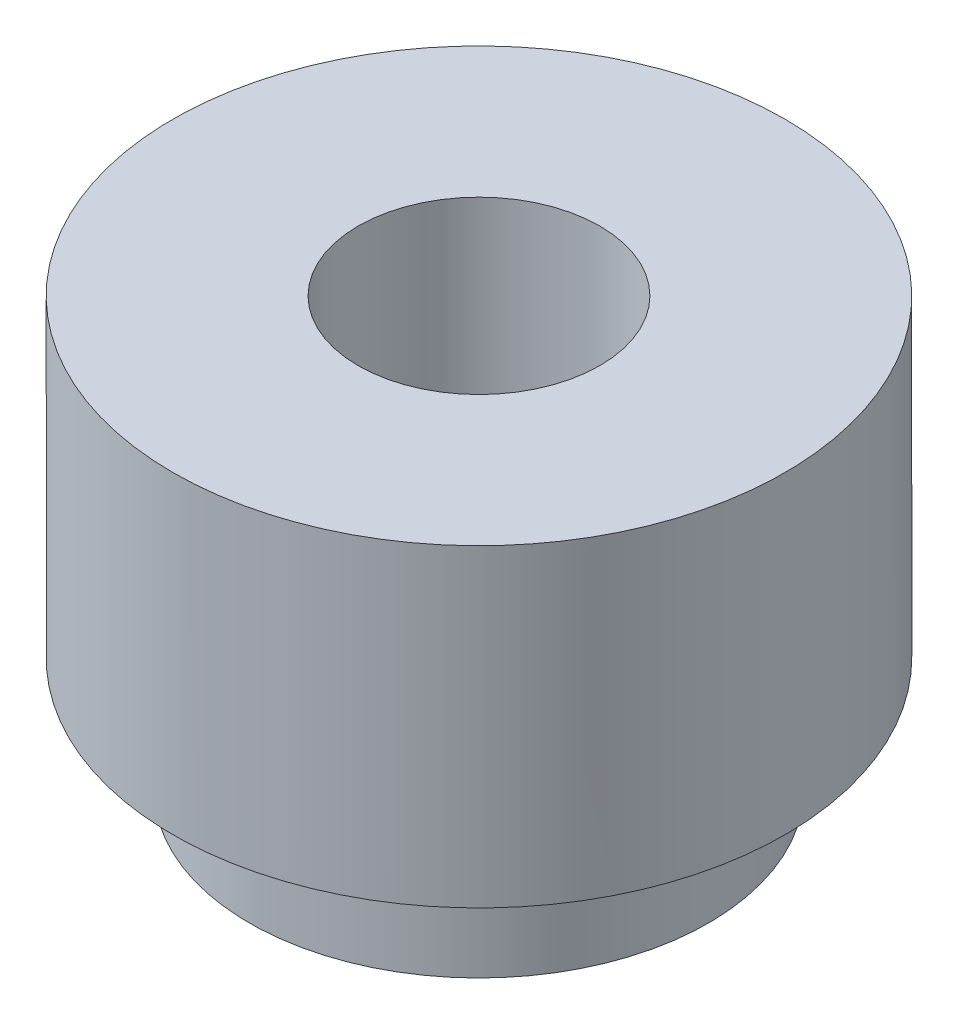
from build123d import *

# Parameters (mm, degrees)
SKETCH1_R      = 25.4
SKETCH1_R_2    = 10.033
EXTRUDE1_DEPTH = 35.56
SKETCH2_W      = 6.35
SKETCH2_H      = 9.525


with BuildPart() as part:
    # Sketch1 → Extrude1 (new body)
    with BuildSketch(Plane(origin=(0, 0, 0), x_dir=(1, 0, 0), z_dir=(0, 1, 0))):
        with Locations(Location((0, 0, 0), (0, 0, 270))):
            Circle(SKETCH1_R)
        with Locations(Location((0, 0, 0), (0, 0, 270))):
            Circle(SKETCH1_R_2, mode=Mode.SUBTRACT)
    extrude(amount=EXTRUDE1_DEPTH)

    # Sketch2 → Cut-Revolve1 (revolve, cut)
    with BuildSketch(Plane.XY, mode=Mode.PRIVATE) as cut_revolve1_sk:
        with Locations((22.225, 4.7625)):
            Rectangle(SKETCH2_W, SKETCH2_H)
    revolve(cut_revolve1_sk.sketch.rotate(Axis((0, 0, 0), (0, 1, 0)), 90), axis=Axis((0, 0, 0), (0, 1, 0)), mode=Mode.SUBTRACT)


solid = part.part
